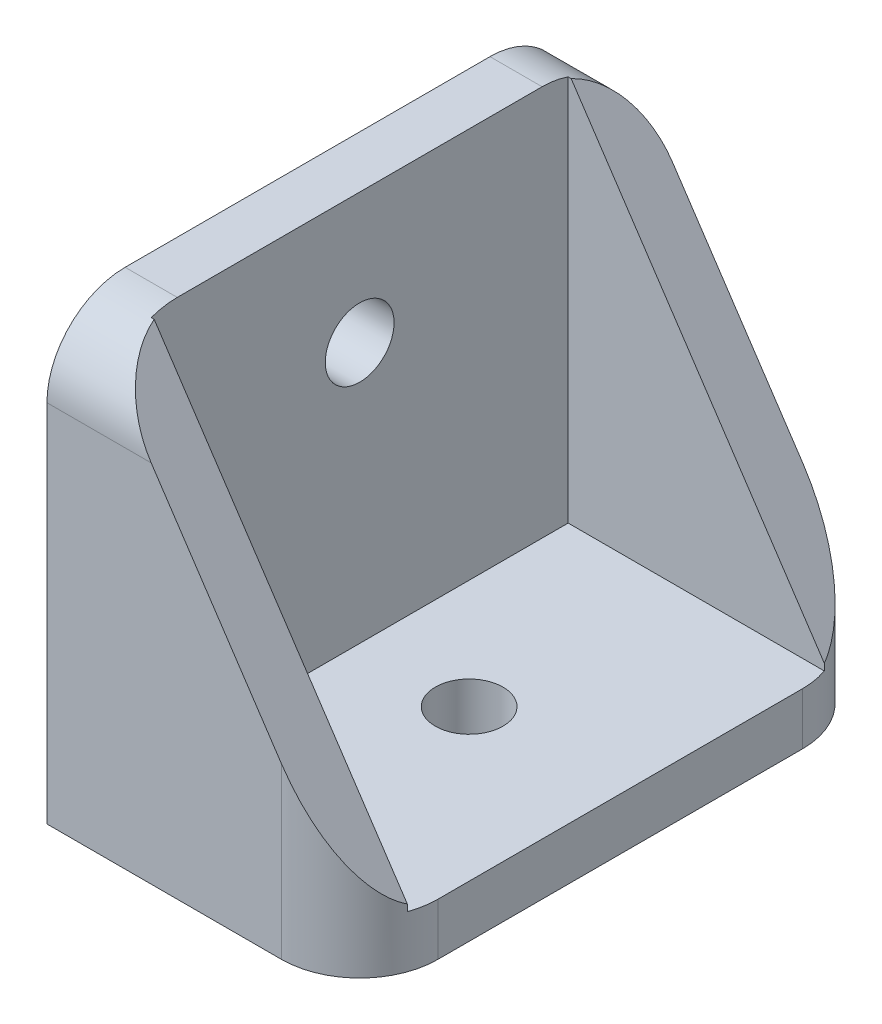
ISO-10303-21;
HEADER;
FILE_DESCRIPTION(('STEP AP214'),'2;1');
FILE_NAME('part.step','',(''),(''),'','','');
FILE_SCHEMA(('AUTOMOTIVE_DESIGN { 1 0 10303 214 1 1 1 1 }'));
ENDSEC;
DATA;
#1=APPLICATION_CONTEXT('core data for automotive mechanical design processes');
#2=APPLICATION_PROTOCOL_DEFINITION('international standard','automotive_design',2000,#1);
#3=PRODUCT_CONTEXT('',#1,'mechanical');
#4=PRODUCT('Part','Part','',(#3));
#5=PRODUCT_RELATED_PRODUCT_CATEGORY('part','',(#4));
#6=PRODUCT_DEFINITION_FORMATION('','',#4);
#7=PRODUCT_DEFINITION_CONTEXT('part definition',#1,'design');
#8=PRODUCT_DEFINITION('design','',#6,#7);
#9=PRODUCT_DEFINITION_SHAPE('','',#8);
#10=(LENGTH_UNIT() NAMED_UNIT(*) SI_UNIT(.MILLI.,.METRE.));
#11=(NAMED_UNIT(*) PLANE_ANGLE_UNIT() SI_UNIT($,.RADIAN.));
#12=(NAMED_UNIT(*) SI_UNIT($,.STERADIAN.) SOLID_ANGLE_UNIT());
#13=UNCERTAINTY_MEASURE_WITH_UNIT(LENGTH_MEASURE(1.E-05),#10,'distance_accuracy_value','');
#14=(GEOMETRIC_REPRESENTATION_CONTEXT(3) GLOBAL_UNCERTAINTY_ASSIGNED_CONTEXT((#13)) GLOBAL_UNIT_ASSIGNED_CONTEXT((#10,
#11,#12)) REPRESENTATION_CONTEXT('',''));
#15=CARTESIAN_POINT('',(0.,0.,0.));
#16=DIRECTION('',(0.,0.,1.));
#17=DIRECTION('',(1.,0.,0.));
#18=AXIS2_PLACEMENT_3D('',#15,#16,#17);
#19=CARTESIAN_POINT('',(11.43,2.54,-3.81));
#20=DIRECTION('',(0.,-1.,0.));
#21=DIRECTION('',(0.,0.,-1.));
#22=AXIS2_PLACEMENT_3D('',#19,#20,#21);
#23=CYLINDRICAL_SURFACE('',#22,3.81);
#24=DIRECTION('',(0.,-1.,0.));
#25=VECTOR('',#24,1.);
#26=CARTESIAN_POINT('',(15.24,2.54,-3.81));
#27=LINE('',#26,#25);
#28=CARTESIAN_POINT('',(15.24,2.54,-3.81));
#29=VERTEX_POINT('',#28);
#30=CARTESIAN_POINT('',(15.24,0.,-3.81));
#31=VERTEX_POINT('',#30);
#32=EDGE_CURVE('E242',#29,#31,#27,.T.);
#33=ORIENTED_EDGE('',*,*,#32,.F.);
#34=CARTESIAN_POINT('',(11.43,2.54,-3.81));
#35=DIRECTION('',(0.,-1.,0.));
#36=DIRECTION('',(0.,0.,-1.));
#37=AXIS2_PLACEMENT_3D('',#34,#35,#36);
#38=CIRCLE('',#37,3.81);
#39=CARTESIAN_POINT('',(15.0221024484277,2.54,-2.54));
#40=VERTEX_POINT('',#39);
#41=EDGE_CURVE('E50',#40,#29,#38,.F.);
#42=ORIENTED_EDGE('',*,*,#41,.F.);
#43=DIRECTION('',(0.,-1.,0.));
#44=VECTOR('',#43,1.);
#45=CARTESIAN_POINT('',(15.0221024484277,2.54,-2.54));
#46=LINE('',#45,#44);
#47=CARTESIAN_POINT('',(15.0221024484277,2.86684632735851,-2.54));
#48=VERTEX_POINT('',#47);
#49=EDGE_CURVE('E60',#48,#40,#46,.T.);
#50=ORIENTED_EDGE('',*,*,#49,.F.);
#51=CARTESIAN_POINT('',(11.43,8.255,-3.81));
#52=DIRECTION('',(0.832050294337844,0.554700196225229,0.));
#53=DIRECTION('',(0.554700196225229,-0.832050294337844,0.));
#54=AXIS2_PLACEMENT_3D('',#51,#52,#53);
#55=ELLIPSE('',#54,6.8685751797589,3.81);
#56=CARTESIAN_POINT('',(11.43,8.255,0.));
#57=VERTEX_POINT('',#56);
#58=EDGE_CURVE('E248',#57,#48,#55,.T.);
#59=ORIENTED_EDGE('',*,*,#58,.F.);
#60=DIRECTION('',(0.,-1.,0.));
#61=VECTOR('',#60,1.);
#62=CARTESIAN_POINT('',(11.43,2.54,0.));
#63=LINE('',#62,#61);
#64=CARTESIAN_POINT('',(11.43,0.,0.));
#65=VERTEX_POINT('',#64);
#66=EDGE_CURVE('E245',#65,#57,#63,.F.);
#67=ORIENTED_EDGE('',*,*,#66,.F.);
#68=CARTESIAN_POINT('',(11.43,0.,-3.81));
#69=DIRECTION('',(0.,-1.,0.));
#70=DIRECTION('',(0.,0.,-1.));
#71=AXIS2_PLACEMENT_3D('',#68,#69,#70);
#72=CIRCLE('',#71,3.81);
#73=EDGE_CURVE('E11',#31,#65,#72,.T.);
#74=ORIENTED_EDGE('',*,*,#73,.F.);
#75=EDGE_LOOP('',(#33,#42,#50,#59,#67,#74));
#76=FACE_BOUND('',#75,.T.);
#77=ADVANCED_FACE('F43',(#76),#23,.T.);
#78=CARTESIAN_POINT('',(11.43,2.54,-21.59));
#79=DIRECTION('',(0.,-1.,0.));
#80=DIRECTION('',(0.,0.,-1.));
#81=AXIS2_PLACEMENT_3D('',#78,#79,#80);
#82=CYLINDRICAL_SURFACE('',#81,3.81);
#83=DIRECTION('',(0.,-1.,0.));
#84=VECTOR('',#83,1.);
#85=CARTESIAN_POINT('',(11.43,2.54,-25.4));
#86=LINE('',#85,#84);
#87=CARTESIAN_POINT('',(11.43,8.255,-25.4));
#88=VERTEX_POINT('',#87);
#89=CARTESIAN_POINT('',(11.43,0.,-25.4));
#90=VERTEX_POINT('',#89);
#91=EDGE_CURVE('E226',#88,#90,#86,.T.);
#92=ORIENTED_EDGE('',*,*,#91,.F.);
#93=CARTESIAN_POINT('',(11.43,8.255,-21.59));
#94=DIRECTION('',(-0.832050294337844,-0.554700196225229,0.));
#95=DIRECTION('',(0.554700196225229,-0.832050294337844,0.));
#96=AXIS2_PLACEMENT_3D('',#93,#94,#95);
#97=ELLIPSE('',#96,6.8685751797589,3.81);
#98=CARTESIAN_POINT('',(15.0221024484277,2.86684632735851,-22.86));
#99=VERTEX_POINT('',#98);
#100=EDGE_CURVE('E237',#99,#88,#97,.F.);
#101=ORIENTED_EDGE('',*,*,#100,.F.);
#102=DIRECTION('',(0.,-1.,0.));
#103=VECTOR('',#102,1.);
#104=CARTESIAN_POINT('',(15.0221024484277,2.54,-22.86));
#105=LINE('',#104,#103);
#106=CARTESIAN_POINT('',(15.0221024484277,2.54,-22.86));
#107=VERTEX_POINT('',#106);
#108=EDGE_CURVE('E234',#107,#99,#105,.F.);
#109=ORIENTED_EDGE('',*,*,#108,.F.);
#110=CARTESIAN_POINT('',(11.43,2.54,-21.59));
#111=DIRECTION('',(0.,-1.,0.));
#112=DIRECTION('',(0.,0.,-1.));
#113=AXIS2_PLACEMENT_3D('',#110,#111,#112);
#114=CIRCLE('',#113,3.81);
#115=CARTESIAN_POINT('',(15.24,2.54,-21.59));
#116=VERTEX_POINT('',#115);
#117=EDGE_CURVE('E232',#116,#107,#114,.F.);
#118=ORIENTED_EDGE('',*,*,#117,.F.);
#119=DIRECTION('',(0.,-1.,0.));
#120=VECTOR('',#119,1.);
#121=CARTESIAN_POINT('',(15.24,2.54,-21.59));
#122=LINE('',#121,#120);
#123=CARTESIAN_POINT('',(15.24,0.,-21.59));
#124=VERTEX_POINT('',#123);
#125=EDGE_CURVE('E229',#124,#116,#122,.F.);
#126=ORIENTED_EDGE('',*,*,#125,.F.);
#127=CARTESIAN_POINT('',(11.43,0.,-21.59));
#128=DIRECTION('',(0.,-1.,0.));
#129=DIRECTION('',(0.,0.,-1.));
#130=AXIS2_PLACEMENT_3D('',#127,#128,#129);
#131=CIRCLE('',#130,3.81);
#132=EDGE_CURVE('E239',#90,#124,#131,.T.);
#133=ORIENTED_EDGE('',*,*,#132,.F.);
#134=EDGE_LOOP('',(#92,#101,#109,#118,#126,#133));
#135=FACE_BOUND('',#134,.T.);
#136=ADVANCED_FACE('F259',(#135),#82,.T.);
#137=CARTESIAN_POINT('',(0.,17.78,-21.59));
#138=DIRECTION('',(-1.,0.,0.));
#139=DIRECTION('',(0.,0.,1.));
#140=AXIS2_PLACEMENT_3D('',#137,#138,#139);
#141=CYLINDRICAL_SURFACE('',#140,3.81);
#142=DIRECTION('',(1.,0.,0.));
#143=VECTOR('',#142,1.);
#144=CARTESIAN_POINT('',(0.,17.78,-25.4));
#145=LINE('',#144,#143);
#146=CARTESIAN_POINT('',(0.,17.78,-25.4));
#147=VERTEX_POINT('',#146);
#148=CARTESIAN_POINT('',(5.08,17.78,-25.4));
#149=VERTEX_POINT('',#148);
#150=EDGE_CURVE('E209',#147,#149,#145,.T.);
#151=ORIENTED_EDGE('',*,*,#150,.F.);
#152=CARTESIAN_POINT('',(0.,17.78,-21.59));
#153=DIRECTION('',(1.,0.,0.));
#154=DIRECTION('',(0.,0.,-1.));
#155=AXIS2_PLACEMENT_3D('',#152,#153,#154);
#156=CIRCLE('',#155,3.81);
#157=CARTESIAN_POINT('',(0.,21.59,-21.59));
#158=VERTEX_POINT('',#157);
#159=EDGE_CURVE('E224',#158,#147,#156,.F.);
#160=ORIENTED_EDGE('',*,*,#159,.F.);
#161=DIRECTION('',(1.,0.,0.));
#162=VECTOR('',#161,1.);
#163=CARTESIAN_POINT('',(0.,21.59,-21.59));
#164=LINE('',#163,#162);
#165=CARTESIAN_POINT('',(2.54,21.59,-21.59));
#166=VERTEX_POINT('',#165);
#167=EDGE_CURVE('E221',#166,#158,#164,.F.);
#168=ORIENTED_EDGE('',*,*,#167,.F.);
#169=CARTESIAN_POINT('',(2.54,17.78,-21.59));
#170=DIRECTION('',(-1.,0.,0.));
#171=DIRECTION('',(0.,0.,1.));
#172=AXIS2_PLACEMENT_3D('',#169,#170,#171);
#173=CIRCLE('',#172,3.81);
#174=CARTESIAN_POINT('',(2.54,21.3721024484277,-22.86));
#175=VERTEX_POINT('',#174);
#176=EDGE_CURVE('E218',#175,#166,#173,.F.);
#177=ORIENTED_EDGE('',*,*,#176,.F.);
#178=DIRECTION('',(-1.,0.,0.));
#179=VECTOR('',#178,1.);
#180=CARTESIAN_POINT('',(0.,21.3721024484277,-22.86));
#181=LINE('',#180,#179);
#182=CARTESIAN_POINT('',(2.68526503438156,21.3721024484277,-22.86));
#183=VERTEX_POINT('',#182);
#184=EDGE_CURVE('E215',#183,#175,#181,.T.);
#185=ORIENTED_EDGE('',*,*,#184,.F.);
#186=CARTESIAN_POINT('',(5.08,17.78,-21.59));
#187=DIRECTION('',(-0.832050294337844,-0.554700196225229,0.));
#188=DIRECTION('',(-0.554700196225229,0.832050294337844,0.));
#189=AXIS2_PLACEMENT_3D('',#186,#187,#188);
#190=ELLIPSE('',#189,4.57905011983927,3.81);
#191=EDGE_CURVE('E212',#149,#183,#190,.F.);
#192=ORIENTED_EDGE('',*,*,#191,.F.);
#193=EDGE_LOOP('',(#151,#160,#168,#177,#185,#192));
#194=FACE_BOUND('',#193,.T.);
#195=ADVANCED_FACE('F310',(#194),#141,.T.);
#196=CARTESIAN_POINT('',(0.,17.78,-3.81));
#197=DIRECTION('',(-1.,0.,0.));
#198=DIRECTION('',(0.,0.,1.));
#199=AXIS2_PLACEMENT_3D('',#196,#197,#198);
#200=CYLINDRICAL_SURFACE('',#199,3.81);
#201=DIRECTION('',(1.,0.,0.));
#202=VECTOR('',#201,1.);
#203=CARTESIAN_POINT('',(0.,21.59,-3.81));
#204=LINE('',#203,#202);
#205=CARTESIAN_POINT('',(0.,21.59,-3.81));
#206=VERTEX_POINT('',#205);
#207=CARTESIAN_POINT('',(2.54,21.59,-3.81));
#208=VERTEX_POINT('',#207);
#209=EDGE_CURVE('E194',#206,#208,#204,.T.);
#210=ORIENTED_EDGE('',*,*,#209,.F.);
#211=CARTESIAN_POINT('',(0.,17.78,-3.81));
#212=DIRECTION('',(1.,0.,0.));
#213=DIRECTION('',(0.,0.,-1.));
#214=AXIS2_PLACEMENT_3D('',#211,#212,#213);
#215=CIRCLE('',#214,3.81);
#216=CARTESIAN_POINT('',(0.,17.78,0.));
#217=VERTEX_POINT('',#216);
#218=EDGE_CURVE('E206',#217,#206,#215,.F.);
#219=ORIENTED_EDGE('',*,*,#218,.F.);
#220=DIRECTION('',(1.,0.,0.));
#221=VECTOR('',#220,1.);
#222=CARTESIAN_POINT('',(0.,17.78,0.));
#223=LINE('',#222,#221);
#224=CARTESIAN_POINT('',(5.08,17.78,0.));
#225=VERTEX_POINT('',#224);
#226=EDGE_CURVE('E203',#225,#217,#223,.F.);
#227=ORIENTED_EDGE('',*,*,#226,.F.);
#228=CARTESIAN_POINT('',(5.08,17.78,-3.81));
#229=DIRECTION('',(0.832050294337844,0.554700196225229,0.));
#230=DIRECTION('',(-0.554700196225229,0.832050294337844,0.));
#231=AXIS2_PLACEMENT_3D('',#228,#229,#230);
#232=ELLIPSE('',#231,4.57905011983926,3.81);
#233=CARTESIAN_POINT('',(2.68526503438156,21.3721024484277,-2.54));
#234=VERTEX_POINT('',#233);
#235=EDGE_CURVE('E200',#234,#225,#232,.T.);
#236=ORIENTED_EDGE('',*,*,#235,.F.);
#237=DIRECTION('',(-1.,0.,0.));
#238=VECTOR('',#237,1.);
#239=CARTESIAN_POINT('',(0.,21.3721024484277,-2.54));
#240=LINE('',#239,#238);
#241=CARTESIAN_POINT('',(2.54,21.3721024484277,-2.54));
#242=VERTEX_POINT('',#241);
#243=EDGE_CURVE('E198',#242,#234,#240,.F.);
#244=ORIENTED_EDGE('',*,*,#243,.F.);
#245=CARTESIAN_POINT('',(2.54,17.78,-3.81));
#246=DIRECTION('',(-1.,0.,0.));
#247=DIRECTION('',(0.,0.,1.));
#248=AXIS2_PLACEMENT_3D('',#245,#246,#247);
#249=CIRCLE('',#248,3.81);
#250=EDGE_CURVE('E148',#208,#242,#249,.F.);
#251=ORIENTED_EDGE('',*,*,#250,.F.);
#252=EDGE_LOOP('',(#210,#219,#227,#236,#244,#251));
#253=FACE_BOUND('',#252,.T.);
#254=ADVANCED_FACE('F300',(#253),#200,.T.);
#255=CARTESIAN_POINT('',(0.,2.54,0.));
#256=DIRECTION('',(0.,-1.,0.));
#257=DIRECTION('',(0.,0.,-1.));
#258=AXIS2_PLACEMENT_3D('',#255,#256,#257);
#259=PLANE('',#258);
#260=CARTESIAN_POINT('',(7.874,2.54,-12.7));
#261=DIRECTION('',(0.,1.,0.));
#262=DIRECTION('',(0.,0.,1.));
#263=AXIS2_PLACEMENT_3D('',#260,#261,#262);
#264=CIRCLE('',#263,1.651);
#265=CARTESIAN_POINT('',(7.874,2.54,-11.049));
#266=VERTEX_POINT('',#265);
#267=EDGE_CURVE('E168',#266,#266,#264,.T.);
#268=ORIENTED_EDGE('',*,*,#267,.F.);
#269=EDGE_LOOP('',(#268));
#270=FACE_BOUND('',#269,.T.);
#271=DIRECTION('',(1.,0.,0.));
#272=VECTOR('',#271,1.);
#273=CARTESIAN_POINT('',(2.54,2.54,-2.54));
#274=LINE('',#273,#272);
#275=CARTESIAN_POINT('',(2.54,2.54,-2.54));
#276=VERTEX_POINT('',#275);
#277=EDGE_CURVE('E151',#276,#40,#274,.T.);
#278=ORIENTED_EDGE('',*,*,#277,.T.);
#279=ORIENTED_EDGE('',*,*,#41,.T.);
#280=DIRECTION('',(0.,0.,-1.));
#281=VECTOR('',#280,1.);
#282=CARTESIAN_POINT('',(15.24,2.54,0.));
#283=LINE('',#282,#281);
#284=EDGE_CURVE('E178',#29,#116,#283,.T.);
#285=ORIENTED_EDGE('',*,*,#284,.T.);
#286=ORIENTED_EDGE('',*,*,#117,.T.);
#287=DIRECTION('',(1.,0.,0.));
#288=VECTOR('',#287,1.);
#289=CARTESIAN_POINT('',(0.,2.54,-22.86));
#290=LINE('',#289,#288);
#291=CARTESIAN_POINT('',(2.54,2.54,-22.86));
#292=VERTEX_POINT('',#291);
#293=EDGE_CURVE('E163',#292,#107,#290,.T.);
#294=ORIENTED_EDGE('',*,*,#293,.F.);
#295=DIRECTION('',(0.,0.,-1.));
#296=VECTOR('',#295,1.);
#297=CARTESIAN_POINT('',(2.54,2.54,0.));
#298=LINE('',#297,#296);
#299=EDGE_CURVE('E145',#276,#292,#298,.T.);
#300=ORIENTED_EDGE('',*,*,#299,.F.);
#301=EDGE_LOOP('',(#278,#279,#285,#286,#294,#300));
#302=FACE_BOUND('',#301,.T.);
#303=ADVANCED_FACE('F160',(#270,#302),#259,.F.);
#304=CARTESIAN_POINT('',(2.54,21.59,-25.4));
#305=DIRECTION('',(-1.,0.,0.));
#306=DIRECTION('',(0.,0.,1.));
#307=AXIS2_PLACEMENT_3D('',#304,#305,#306);
#308=PLANE('',#307);
#309=CARTESIAN_POINT('',(2.54,15.24,-12.7));
#310=DIRECTION('',(1.,0.,0.));
#311=DIRECTION('',(0.,0.,-1.));
#312=AXIS2_PLACEMENT_3D('',#309,#310,#311);
#313=CIRCLE('',#312,1.6764);
#314=CARTESIAN_POINT('',(2.54,15.24,-14.3764));
#315=VERTEX_POINT('',#314);
#316=EDGE_CURVE('E274',#315,#315,#313,.T.);
#317=ORIENTED_EDGE('',*,*,#316,.F.);
#318=EDGE_LOOP('',(#317));
#319=FACE_BOUND('',#318,.T.);
#320=DIRECTION('',(0.,-1.,0.));
#321=VECTOR('',#320,1.);
#322=CARTESIAN_POINT('',(2.54,21.59,-22.86));
#323=LINE('',#322,#321);
#324=EDGE_CURVE('E263',#175,#292,#323,.T.);
#325=ORIENTED_EDGE('',*,*,#324,.F.);
#326=ORIENTED_EDGE('',*,*,#176,.T.);
#327=DIRECTION('',(0.,0.,-1.));
#328=VECTOR('',#327,1.);
#329=CARTESIAN_POINT('',(2.54,21.59,-25.4));
#330=LINE('',#329,#328);
#331=EDGE_CURVE('E165',#208,#166,#330,.T.);
#332=ORIENTED_EDGE('',*,*,#331,.F.);
#333=ORIENTED_EDGE('',*,*,#250,.T.);
#334=DIRECTION('',(0.,-1.,0.));
#335=VECTOR('',#334,1.);
#336=CARTESIAN_POINT('',(2.54,21.59,-2.54));
#337=LINE('',#336,#335);
#338=EDGE_CURVE('E140',#242,#276,#337,.T.);
#339=ORIENTED_EDGE('',*,*,#338,.T.);
#340=ORIENTED_EDGE('',*,*,#299,.T.);
#341=EDGE_LOOP('',(#325,#326,#332,#333,#339,#340));
#342=FACE_BOUND('',#341,.T.);
#343=ADVANCED_FACE('F143',(#319,#342),#308,.F.);
#344=CARTESIAN_POINT('',(0.,0.,0.));
#345=DIRECTION('',(0.,-1.,0.));
#346=DIRECTION('',(0.,0.,-1.));
#347=AXIS2_PLACEMENT_3D('',#344,#345,#346);
#348=PLANE('',#347);
#349=DIRECTION('',(0.,0.,-1.));
#350=VECTOR('',#349,1.);
#351=CARTESIAN_POINT('',(15.24,0.,0.));
#352=LINE('',#351,#350);
#353=EDGE_CURVE('E187',#31,#124,#352,.T.);
#354=ORIENTED_EDGE('',*,*,#353,.F.);
#355=ORIENTED_EDGE('',*,*,#73,.T.);
#356=DIRECTION('',(1.,0.,0.));
#357=VECTOR('',#356,1.);
#358=CARTESIAN_POINT('',(0.,0.,0.));
#359=LINE('',#358,#357);
#360=CARTESIAN_POINT('',(0.,0.,0.));
#361=VERTEX_POINT('',#360);
#362=EDGE_CURVE('E184',#361,#65,#359,.T.);
#363=ORIENTED_EDGE('',*,*,#362,.F.);
#364=DIRECTION('',(0.,0.,1.));
#365=VECTOR('',#364,1.);
#366=CARTESIAN_POINT('',(0.,0.,0.));
#367=LINE('',#366,#365);
#368=CARTESIAN_POINT('',(0.,0.,-25.4));
#369=VERTEX_POINT('',#368);
#370=EDGE_CURVE('E176',#369,#361,#367,.T.);
#371=ORIENTED_EDGE('',*,*,#370,.F.);
#372=DIRECTION('',(-1.,0.,0.));
#373=VECTOR('',#372,1.);
#374=CARTESIAN_POINT('',(0.,0.,-25.4));
#375=LINE('',#374,#373);
#376=EDGE_CURVE('E181',#90,#369,#375,.T.);
#377=ORIENTED_EDGE('',*,*,#376,.F.);
#378=ORIENTED_EDGE('',*,*,#132,.T.);
#379=EDGE_LOOP('',(#354,#355,#363,#371,#377,#378));
#380=FACE_BOUND('',#379,.T.);
#381=CARTESIAN_POINT('',(7.874,0.,-12.7));
#382=DIRECTION('',(0.,1.,0.));
#383=DIRECTION('',(0.,0.,1.));
#384=AXIS2_PLACEMENT_3D('',#381,#382,#383);
#385=CIRCLE('',#384,1.651);
#386=CARTESIAN_POINT('',(7.874,0.,-11.049));
#387=VERTEX_POINT('',#386);
#388=EDGE_CURVE('E164',#387,#387,#385,.T.);
#389=ORIENTED_EDGE('',*,*,#388,.T.);
#390=EDGE_LOOP('',(#389));
#391=FACE_BOUND('',#390,.T.);
#392=ADVANCED_FACE('F290',(#380,#391),#348,.T.);
#393=CARTESIAN_POINT('',(0.,2.54,0.));
#394=DIRECTION('',(1.,0.,0.));
#395=DIRECTION('',(0.,0.,-1.));
#396=AXIS2_PLACEMENT_3D('',#393,#394,#395);
#397=PLANE('',#396);
#398=CARTESIAN_POINT('',(0.,15.24,-12.7));
#399=DIRECTION('',(1.,0.,0.));
#400=DIRECTION('',(0.,0.,-1.));
#401=AXIS2_PLACEMENT_3D('',#398,#399,#400);
#402=CIRCLE('',#401,1.6764);
#403=CARTESIAN_POINT('',(0.,15.24,-14.3764));
#404=VERTEX_POINT('',#403);
#405=EDGE_CURVE('E272',#404,#404,#402,.T.);
#406=ORIENTED_EDGE('',*,*,#405,.T.);
#407=EDGE_LOOP('',(#406));
#408=FACE_BOUND('',#407,.T.);
#409=DIRECTION('',(0.,0.,1.));
#410=VECTOR('',#409,1.);
#411=CARTESIAN_POINT('',(0.,21.59,-25.4));
#412=LINE('',#411,#410);
#413=EDGE_CURVE('E171',#158,#206,#412,.T.);
#414=ORIENTED_EDGE('',*,*,#413,.F.);
#415=ORIENTED_EDGE('',*,*,#159,.T.);
#416=DIRECTION('',(0.,-1.,0.));
#417=VECTOR('',#416,1.);
#418=CARTESIAN_POINT('',(0.,2.54,-25.4));
#419=LINE('',#418,#417);
#420=EDGE_CURVE('E180',#147,#369,#419,.T.);
#421=ORIENTED_EDGE('',*,*,#420,.T.);
#422=ORIENTED_EDGE('',*,*,#370,.T.);
#423=DIRECTION('',(0.,-1.,0.));
#424=VECTOR('',#423,1.);
#425=CARTESIAN_POINT('',(0.,2.54,0.));
#426=LINE('',#425,#424);
#427=EDGE_CURVE('E192',#217,#361,#426,.T.);
#428=ORIENTED_EDGE('',*,*,#427,.F.);
#429=ORIENTED_EDGE('',*,*,#218,.T.);
#430=EDGE_LOOP('',(#414,#415,#421,#422,#428,#429));
#431=FACE_BOUND('',#430,.T.);
#432=ADVANCED_FACE('F280',(#408,#431),#397,.F.);
#433=CARTESIAN_POINT('',(0.,2.54,0.));
#434=DIRECTION('',(0.,0.,-1.));
#435=DIRECTION('',(-1.,0.,0.));
#436=AXIS2_PLACEMENT_3D('',#433,#434,#435);
#437=PLANE('',#436);
#438=ORIENTED_EDGE('',*,*,#362,.T.);
#439=ORIENTED_EDGE('',*,*,#66,.T.);
#440=DIRECTION('',(-0.554700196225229,0.832050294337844,0.));
#441=VECTOR('',#440,1.);
#442=CARTESIAN_POINT('',(2.54,21.59,0.));
#443=LINE('',#442,#441);
#444=EDGE_CURVE('E152',#57,#225,#443,.T.);
#445=ORIENTED_EDGE('',*,*,#444,.T.);
#446=ORIENTED_EDGE('',*,*,#226,.T.);
#447=ORIENTED_EDGE('',*,*,#427,.T.);
#448=EDGE_LOOP('',(#438,#439,#445,#446,#447));
#449=FACE_BOUND('',#448,.T.);
#450=ADVANCED_FACE('F323',(#449),#437,.F.);
#451=CARTESIAN_POINT('',(15.24,2.54,0.));
#452=DIRECTION('',(-1.,0.,0.));
#453=DIRECTION('',(0.,0.,1.));
#454=AXIS2_PLACEMENT_3D('',#451,#452,#453);
#455=PLANE('',#454);
#456=ORIENTED_EDGE('',*,*,#284,.F.);
#457=ORIENTED_EDGE('',*,*,#32,.T.);
#458=ORIENTED_EDGE('',*,*,#353,.T.);
#459=ORIENTED_EDGE('',*,*,#125,.T.);
#460=EDGE_LOOP('',(#456,#457,#458,#459));
#461=FACE_BOUND('',#460,.T.);
#462=ADVANCED_FACE('F255',(#461),#455,.F.);
#463=CARTESIAN_POINT('',(0.,2.54,-25.4));
#464=DIRECTION('',(0.,0.,1.));
#465=DIRECTION('',(1.,0.,0.));
#466=AXIS2_PLACEMENT_3D('',#463,#464,#465);
#467=PLANE('',#466);
#468=DIRECTION('',(-0.554700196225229,0.832050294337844,0.));
#469=VECTOR('',#468,1.);
#470=CARTESIAN_POINT('',(15.24,2.54,-25.4));
#471=LINE('',#470,#469);
#472=EDGE_CURVE('E265',#88,#149,#471,.T.);
#473=ORIENTED_EDGE('',*,*,#472,.F.);
#474=ORIENTED_EDGE('',*,*,#91,.T.);
#475=ORIENTED_EDGE('',*,*,#376,.T.);
#476=ORIENTED_EDGE('',*,*,#420,.F.);
#477=ORIENTED_EDGE('',*,*,#150,.T.);
#478=EDGE_LOOP('',(#473,#474,#475,#476,#477));
#479=FACE_BOUND('',#478,.T.);
#480=ADVANCED_FACE('F329',(#479),#467,.F.);
#481=CARTESIAN_POINT('',(7.874,2.54,-12.7));
#482=DIRECTION('',(0.,-1.,0.));
#483=DIRECTION('',(0.,0.,-1.));
#484=AXIS2_PLACEMENT_3D('',#481,#482,#483);
#485=CYLINDRICAL_SURFACE('',#484,1.651);
#486=ORIENTED_EDGE('',*,*,#267,.T.);
#487=EDGE_LOOP('',(#486));
#488=FACE_BOUND('',#487,.T.);
#489=ORIENTED_EDGE('',*,*,#388,.F.);
#490=EDGE_LOOP('',(#489));
#491=FACE_BOUND('',#490,.T.);
#492=ADVANCED_FACE('F330',(#488,#491),#485,.F.);
#493=CARTESIAN_POINT('',(0.,21.59,0.));
#494=DIRECTION('',(0.,1.,0.));
#495=DIRECTION('',(0.,0.,1.));
#496=AXIS2_PLACEMENT_3D('',#493,#494,#495);
#497=PLANE('',#496);
#498=ORIENTED_EDGE('',*,*,#331,.T.);
#499=ORIENTED_EDGE('',*,*,#167,.T.);
#500=ORIENTED_EDGE('',*,*,#413,.T.);
#501=ORIENTED_EDGE('',*,*,#209,.T.);
#502=EDGE_LOOP('',(#498,#499,#500,#501));
#503=FACE_BOUND('',#502,.T.);
#504=ADVANCED_FACE('F333',(#503),#497,.T.);
#505=CARTESIAN_POINT('',(15.24,2.54,-25.4));
#506=DIRECTION('',(-0.832050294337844,-0.554700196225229,0.));
#507=DIRECTION('',(-0.554700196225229,0.832050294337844,0.));
#508=AXIS2_PLACEMENT_3D('',#505,#506,#507);
#509=PLANE('',#508);
#510=DIRECTION('',(-0.554700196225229,0.832050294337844,0.));
#511=VECTOR('',#510,1.);
#512=CARTESIAN_POINT('',(15.24,2.54,-22.86));
#513=LINE('',#512,#511);
#514=EDGE_CURVE('E268',#99,#183,#513,.T.);
#515=ORIENTED_EDGE('',*,*,#514,.F.);
#516=ORIENTED_EDGE('',*,*,#100,.T.);
#517=ORIENTED_EDGE('',*,*,#472,.T.);
#518=ORIENTED_EDGE('',*,*,#191,.T.);
#519=EDGE_LOOP('',(#515,#516,#517,#518));
#520=FACE_BOUND('',#519,.T.);
#521=ADVANCED_FACE('F337',(#520),#509,.F.);
#522=CARTESIAN_POINT('',(7.62,10.795,-22.86));
#523=DIRECTION('',(0.,0.,-1.));
#524=DIRECTION('',(-1.,0.,0.));
#525=AXIS2_PLACEMENT_3D('',#522,#523,#524);
#526=PLANE('',#525);
#527=ORIENTED_EDGE('',*,*,#293,.T.);
#528=ORIENTED_EDGE('',*,*,#108,.T.);
#529=ORIENTED_EDGE('',*,*,#514,.T.);
#530=ORIENTED_EDGE('',*,*,#184,.T.);
#531=ORIENTED_EDGE('',*,*,#324,.T.);
#532=EDGE_LOOP('',(#527,#528,#529,#530,#531));
#533=FACE_BOUND('',#532,.T.);
#534=ADVANCED_FACE('F261',(#533),#526,.F.);
#535=CARTESIAN_POINT('',(2.54,21.59,-2.54));
#536=DIRECTION('',(0.832050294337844,0.554700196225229,0.));
#537=DIRECTION('',(-0.554700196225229,0.832050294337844,0.));
#538=AXIS2_PLACEMENT_3D('',#535,#536,#537);
#539=PLANE('',#538);
#540=ORIENTED_EDGE('',*,*,#444,.F.);
#541=ORIENTED_EDGE('',*,*,#58,.T.);
#542=DIRECTION('',(-0.554700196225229,0.832050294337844,0.));
#543=VECTOR('',#542,1.);
#544=CARTESIAN_POINT('',(2.54,21.59,-2.54));
#545=LINE('',#544,#543);
#546=EDGE_CURVE('E158',#48,#234,#545,.T.);
#547=ORIENTED_EDGE('',*,*,#546,.T.);
#548=ORIENTED_EDGE('',*,*,#235,.T.);
#549=EDGE_LOOP('',(#540,#541,#547,#548));
#550=FACE_BOUND('',#549,.T.);
#551=ADVANCED_FACE('F350',(#550),#539,.T.);
#552=CARTESIAN_POINT('',(0.,0.,-2.54));
#553=DIRECTION('',(0.,0.,1.));
#554=DIRECTION('',(1.,0.,0.));
#555=AXIS2_PLACEMENT_3D('',#552,#553,#554);
#556=PLANE('',#555);
#557=ORIENTED_EDGE('',*,*,#546,.F.);
#558=ORIENTED_EDGE('',*,*,#49,.T.);
#559=ORIENTED_EDGE('',*,*,#277,.F.);
#560=ORIENTED_EDGE('',*,*,#338,.F.);
#561=ORIENTED_EDGE('',*,*,#243,.T.);
#562=EDGE_LOOP('',(#557,#558,#559,#560,#561));
#563=FACE_BOUND('',#562,.T.);
#564=ADVANCED_FACE('F156',(#563),#556,.F.);
#565=CARTESIAN_POINT('',(0.,15.24,-12.7));
#566=DIRECTION('',(1.,0.,0.));
#567=DIRECTION('',(0.,0.,-1.));
#568=AXIS2_PLACEMENT_3D('',#565,#566,#567);
#569=CYLINDRICAL_SURFACE('',#568,1.6764);
#570=ORIENTED_EDGE('',*,*,#405,.F.);
#571=EDGE_LOOP('',(#570));
#572=FACE_BOUND('',#571,.T.);
#573=ORIENTED_EDGE('',*,*,#316,.T.);
#574=EDGE_LOOP('',(#573));
#575=FACE_BOUND('',#574,.T.);
#576=ADVANCED_FACE('F283',(#572,#575),#569,.F.);
#577=CLOSED_SHELL('',(#77,#136,#195,#254,#303,#343,#392,#432,#450,#462,#480,#492,#504,#521,#534,
#551,#564,#576));
#578=MANIFOLD_SOLID_BREP('B2',#577);
#579=ADVANCED_BREP_SHAPE_REPRESENTATION('',(#18,#578),#14);
#580=SHAPE_DEFINITION_REPRESENTATION(#9,#579);
ENDSEC;
END-ISO-10303-21;
